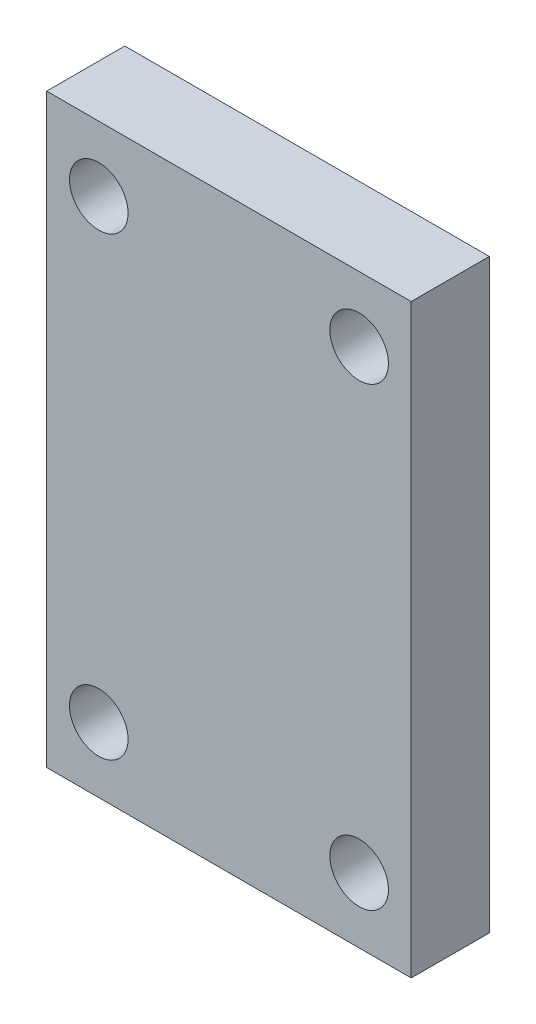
from build123d import *

# Parameters (mm, degrees)
SKETCH_1_W      = 28
SKETCH_1_H      = 45
SKETCH_1_R      = 2.25
EXTRUDE_1_DEPTH = 6


with BuildPart() as part:
    # Sketch 1 → Extrude 1 (new body)
    with BuildSketch(Plane.XY):
        with Locations((14, -22.5)):
            Rectangle(SKETCH_1_W, SKETCH_1_H)
        with Locations((24, -5)):
            Circle(SKETCH_1_R, mode=Mode.SUBTRACT)
        with Locations((4, -5)):
            Circle(SKETCH_1_R, mode=Mode.SUBTRACT)
        with Locations((4, -40)):
            Circle(SKETCH_1_R, mode=Mode.SUBTRACT)
        with Locations((24, -40)):
            Circle(SKETCH_1_R, mode=Mode.SUBTRACT)
    extrude(amount=EXTRUDE_1_DEPTH)


solid = part.part
